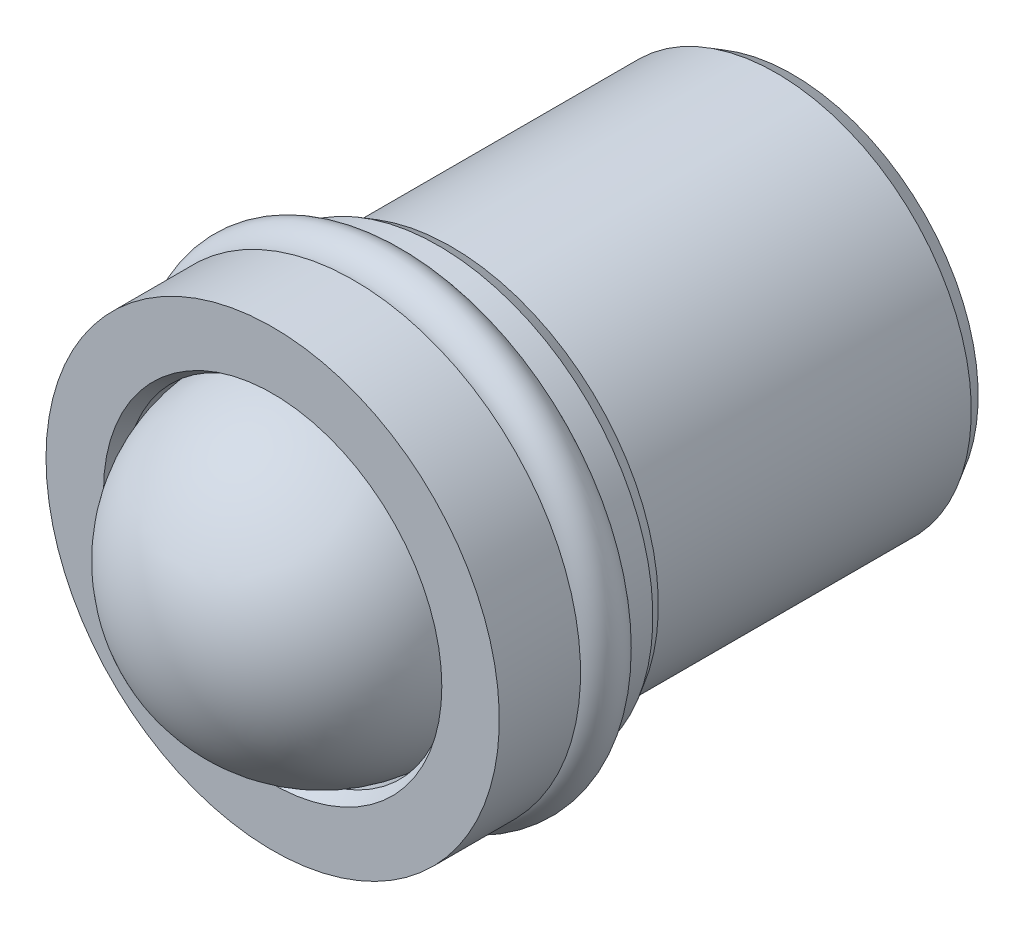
ISO-10303-21;
HEADER;
FILE_DESCRIPTION(('STEP AP214'),'2;1');
FILE_NAME('part.step','',(''),(''),'','','');
FILE_SCHEMA(('AUTOMOTIVE_DESIGN { 1 0 10303 214 1 1 1 1 }'));
ENDSEC;
DATA;
#1=APPLICATION_CONTEXT('core data for automotive mechanical design processes');
#2=APPLICATION_PROTOCOL_DEFINITION('international standard','automotive_design',2000,#1);
#3=PRODUCT_CONTEXT('',#1,'mechanical');
#4=PRODUCT('Part','Part','',(#3));
#5=PRODUCT_RELATED_PRODUCT_CATEGORY('part','',(#4));
#6=PRODUCT_DEFINITION_FORMATION('','',#4);
#7=PRODUCT_DEFINITION_CONTEXT('part definition',#1,'design');
#8=PRODUCT_DEFINITION('design','',#6,#7);
#9=PRODUCT_DEFINITION_SHAPE('','',#8);
#10=(LENGTH_UNIT() NAMED_UNIT(*) SI_UNIT(.MILLI.,.METRE.));
#11=(NAMED_UNIT(*) PLANE_ANGLE_UNIT() SI_UNIT($,.RADIAN.));
#12=(NAMED_UNIT(*) SI_UNIT($,.STERADIAN.) SOLID_ANGLE_UNIT());
#13=UNCERTAINTY_MEASURE_WITH_UNIT(LENGTH_MEASURE(1.E-05),#10,'distance_accuracy_value','');
#14=(GEOMETRIC_REPRESENTATION_CONTEXT(3) GLOBAL_UNCERTAINTY_ASSIGNED_CONTEXT((#13)) GLOBAL_UNIT_ASSIGNED_CONTEXT((#10,
#11,#12)) REPRESENTATION_CONTEXT('',''));
#15=CARTESIAN_POINT('',(0.,0.,0.));
#16=DIRECTION('',(0.,0.,1.));
#17=DIRECTION('',(1.,0.,0.));
#18=AXIS2_PLACEMENT_3D('',#15,#16,#17);
#19=CARTESIAN_POINT('',(0.,0.,-10.));
#20=DIRECTION('',(0.,0.,1.));
#21=DIRECTION('',(1.,0.,0.));
#22=AXIS2_PLACEMENT_3D('',#19,#20,#21);
#23=CONICAL_SURFACE('',#22,6.,0.523598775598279);
#24=CARTESIAN_POINT('',(0.,0.,-10.5));
#25=DIRECTION('',(0.,0.,-1.));
#26=DIRECTION('',(-1.,0.,0.));
#27=AXIS2_PLACEMENT_3D('',#24,#25,#26);
#28=CIRCLE('',#27,5.7113248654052);
#29=CARTESIAN_POINT('',(-5.7113248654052,0.,-10.5));
#30=VERTEX_POINT('',#29);
#31=EDGE_CURVE('E18',#30,#30,#28,.T.);
#32=ORIENTED_EDGE('',*,*,#31,.F.);
#33=EDGE_LOOP('',(#32));
#34=FACE_BOUND('',#33,.T.);
#35=CARTESIAN_POINT('',(0.,0.,-10.));
#36=DIRECTION('',(0.,0.,-1.));
#37=DIRECTION('',(-1.,0.,0.));
#38=AXIS2_PLACEMENT_3D('',#35,#36,#37);
#39=CIRCLE('',#38,6.);
#40=CARTESIAN_POINT('',(-6.,0.,-10.));
#41=VERTEX_POINT('',#40);
#42=EDGE_CURVE('E70',#41,#41,#39,.T.);
#43=ORIENTED_EDGE('',*,*,#42,.T.);
#44=EDGE_LOOP('',(#43));
#45=FACE_BOUND('',#44,.T.);
#46=ADVANCED_FACE('F12',(#34,#45),#23,.T.);
#47=CARTESIAN_POINT('',(0.,5.7113248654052,-10.5));
#48=DIRECTION('',(0.,0.,1.));
#49=DIRECTION('',(1.,0.,0.));
#50=AXIS2_PLACEMENT_3D('',#47,#48,#49);
#51=PLANE('',#50);
#52=ORIENTED_EDGE('',*,*,#31,.T.);
#53=EDGE_LOOP('',(#52));
#54=FACE_BOUND('',#53,.T.);
#55=ADVANCED_FACE('F168',(#54),#51,.F.);
#56=CARTESIAN_POINT('',(0.,0.,5.5));
#57=DIRECTION('',(0.,0.,-1.));
#58=DIRECTION('',(-1.,0.,0.));
#59=AXIS2_PLACEMENT_3D('',#56,#57,#58);
#60=CYLINDRICAL_SURFACE('',#59,4.975);
#61=CARTESIAN_POINT('',(0.,0.,4.49937460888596));
#62=DIRECTION('',(0.,0.,-1.));
#63=DIRECTION('',(-1.,0.,0.));
#64=AXIS2_PLACEMENT_3D('',#61,#62,#63);
#65=CIRCLE('',#64,4.975);
#66=CARTESIAN_POINT('',(-4.975,0.,4.49937460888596));
#67=VERTEX_POINT('',#66);
#68=EDGE_CURVE('E8',#67,#67,#65,.T.);
#69=ORIENTED_EDGE('',*,*,#68,.T.);
#70=EDGE_LOOP('',(#69));
#71=FACE_BOUND('',#70,.T.);
#72=CARTESIAN_POINT('',(0.,0.,5.1));
#73=DIRECTION('',(0.,0.,-1.));
#74=DIRECTION('',(-1.,0.,0.));
#75=AXIS2_PLACEMENT_3D('',#72,#73,#74);
#76=CIRCLE('',#75,4.975);
#77=CARTESIAN_POINT('',(-4.975,0.,5.1));
#78=VERTEX_POINT('',#77);
#79=EDGE_CURVE('E22',#78,#78,#76,.T.);
#80=ORIENTED_EDGE('',*,*,#79,.F.);
#81=EDGE_LOOP('',(#80));
#82=FACE_BOUND('',#81,.T.);
#83=ADVANCED_FACE('F163',(#71,#82),#60,.F.);
#84=CARTESIAN_POINT('',(0.,0.,5.1));
#85=DIRECTION('',(0.,0.,1.));
#86=DIRECTION('',(1.,0.,0.));
#87=AXIS2_PLACEMENT_3D('',#84,#85,#86);
#88=CONICAL_SURFACE('',#87,4.975,0.523598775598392);
#89=CARTESIAN_POINT('',(0.,0.,5.5));
#90=DIRECTION('',(0.,0.,-1.));
#91=DIRECTION('',(-1.,0.,0.));
#92=AXIS2_PLACEMENT_3D('',#89,#90,#91);
#93=CIRCLE('',#92,5.2059401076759);
#94=CARTESIAN_POINT('',(-5.2059401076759,0.,5.5));
#95=VERTEX_POINT('',#94);
#96=EDGE_CURVE('E26',#95,#95,#93,.T.);
#97=ORIENTED_EDGE('',*,*,#96,.F.);
#98=EDGE_LOOP('',(#97));
#99=FACE_BOUND('',#98,.T.);
#100=ORIENTED_EDGE('',*,*,#79,.T.);
#101=EDGE_LOOP('',(#100));
#102=FACE_BOUND('',#101,.T.);
#103=ADVANCED_FACE('F157',(#99,#102),#88,.F.);
#104=CARTESIAN_POINT('',(0.,5.2059401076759,5.5));
#105=DIRECTION('',(0.,0.,-1.));
#106=DIRECTION('',(-1.,0.,0.));
#107=AXIS2_PLACEMENT_3D('',#104,#105,#106);
#108=PLANE('',#107);
#109=CARTESIAN_POINT('',(0.,0.,5.5));
#110=DIRECTION('',(0.,0.,-1.));
#111=DIRECTION('',(-1.,0.,0.));
#112=AXIS2_PLACEMENT_3D('',#109,#110,#111);
#113=CIRCLE('',#112,6.975);
#114=CARTESIAN_POINT('',(-6.975,0.,5.5));
#115=VERTEX_POINT('',#114);
#116=EDGE_CURVE('E31',#115,#115,#113,.T.);
#117=ORIENTED_EDGE('',*,*,#116,.F.);
#118=EDGE_LOOP('',(#117));
#119=FACE_BOUND('',#118,.T.);
#120=ORIENTED_EDGE('',*,*,#96,.T.);
#121=EDGE_LOOP('',(#120));
#122=FACE_BOUND('',#121,.T.);
#123=ADVANCED_FACE('F151',(#119,#122),#108,.F.);
#124=CARTESIAN_POINT('',(0.,0.,5.5));
#125=DIRECTION('',(0.,0.,-1.));
#126=DIRECTION('',(-1.,0.,0.));
#127=AXIS2_PLACEMENT_3D('',#124,#125,#126);
#128=CYLINDRICAL_SURFACE('',#127,6.975);
#129=CARTESIAN_POINT('',(0.,0.,3.));
#130=DIRECTION('',(0.,0.,-1.));
#131=DIRECTION('',(-1.,0.,0.));
#132=AXIS2_PLACEMENT_3D('',#129,#130,#131);
#133=CIRCLE('',#132,6.975);
#134=CARTESIAN_POINT('',(-6.975,0.,3.));
#135=VERTEX_POINT('',#134);
#136=EDGE_CURVE('E34',#135,#135,#133,.T.);
#137=ORIENTED_EDGE('',*,*,#136,.F.);
#138=EDGE_LOOP('',(#137));
#139=FACE_BOUND('',#138,.T.);
#140=ORIENTED_EDGE('',*,*,#116,.T.);
#141=EDGE_LOOP('',(#140));
#142=FACE_BOUND('',#141,.T.);
#143=ADVANCED_FACE('F145',(#139,#142),#128,.T.);
#144=CARTESIAN_POINT('',(0.,6.975,3.));
#145=DIRECTION('',(0.,0.,1.));
#146=DIRECTION('',(1.,0.,0.));
#147=AXIS2_PLACEMENT_3D('',#144,#145,#146);
#148=PLANE('',#147);
#149=CARTESIAN_POINT('',(0.,0.,3.));
#150=DIRECTION('',(0.,0.,-1.));
#151=DIRECTION('',(-1.,0.,0.));
#152=AXIS2_PLACEMENT_3D('',#149,#150,#151);
#153=CIRCLE('',#152,5.825);
#154=CARTESIAN_POINT('',(-5.825,0.,3.));
#155=VERTEX_POINT('',#154);
#156=EDGE_CURVE('E37',#155,#155,#153,.T.);
#157=ORIENTED_EDGE('',*,*,#156,.F.);
#158=EDGE_LOOP('',(#157));
#159=FACE_BOUND('',#158,.T.);
#160=ORIENTED_EDGE('',*,*,#136,.T.);
#161=EDGE_LOOP('',(#160));
#162=FACE_BOUND('',#161,.T.);
#163=ADVANCED_FACE('F139',(#159,#162),#148,.F.);
#164=CARTESIAN_POINT('',(0.,0.,5.5));
#165=DIRECTION('',(0.,0.,-1.));
#166=DIRECTION('',(-1.,0.,0.));
#167=AXIS2_PLACEMENT_3D('',#164,#165,#166);
#168=CYLINDRICAL_SURFACE('',#167,5.825);
#169=CARTESIAN_POINT('',(0.,0.,2.85));
#170=DIRECTION('',(0.,0.,-1.));
#171=DIRECTION('',(-1.,0.,0.));
#172=AXIS2_PLACEMENT_3D('',#169,#170,#171);
#173=CIRCLE('',#172,5.825);
#174=CARTESIAN_POINT('',(-5.825,0.,2.85));
#175=VERTEX_POINT('',#174);
#176=EDGE_CURVE('E40',#175,#175,#173,.T.);
#177=ORIENTED_EDGE('',*,*,#176,.F.);
#178=EDGE_LOOP('',(#177));
#179=FACE_BOUND('',#178,.T.);
#180=ORIENTED_EDGE('',*,*,#156,.T.);
#181=EDGE_LOOP('',(#180));
#182=FACE_BOUND('',#181,.T.);
#183=ADVANCED_FACE('F133',(#179,#182),#168,.T.);
#184=CARTESIAN_POINT('',(0.,5.825,2.85));
#185=DIRECTION('',(0.,0.,-1.));
#186=DIRECTION('',(-1.,0.,0.));
#187=AXIS2_PLACEMENT_3D('',#184,#185,#186);
#188=PLANE('',#187);
#189=CARTESIAN_POINT('',(0.,0.,2.85));
#190=DIRECTION('',(0.,0.,-1.));
#191=DIRECTION('',(-1.,0.,0.));
#192=AXIS2_PLACEMENT_3D('',#189,#190,#191);
#193=CIRCLE('',#192,6.575);
#194=CARTESIAN_POINT('',(-6.575,0.,2.85));
#195=VERTEX_POINT('',#194);
#196=EDGE_CURVE('E43',#195,#195,#193,.T.);
#197=ORIENTED_EDGE('',*,*,#196,.F.);
#198=EDGE_LOOP('',(#197));
#199=FACE_BOUND('',#198,.T.);
#200=ORIENTED_EDGE('',*,*,#176,.T.);
#201=EDGE_LOOP('',(#200));
#202=FACE_BOUND('',#201,.T.);
#203=ADVANCED_FACE('F127',(#199,#202),#188,.F.);
#204=CARTESIAN_POINT('',(0.,0.,2.09999999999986));
#205=DIRECTION('',(0.,0.,-1.));
#206=DIRECTION('',(-1.,0.,0.));
#207=AXIS2_PLACEMENT_3D('',#204,#205,#206);
#208=TOROIDAL_SURFACE('',#207,6.57500000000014,0.749999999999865);
#209=CARTESIAN_POINT('',(0.,0.,1.35));
#210=DIRECTION('',(0.,0.,-1.));
#211=DIRECTION('',(-1.,0.,0.));
#212=AXIS2_PLACEMENT_3D('',#209,#210,#211);
#213=CIRCLE('',#212,6.575);
#214=CARTESIAN_POINT('',(-6.575,0.,1.35));
#215=VERTEX_POINT('',#214);
#216=EDGE_CURVE('E46',#215,#215,#213,.T.);
#217=ORIENTED_EDGE('',*,*,#216,.F.);
#218=EDGE_LOOP('',(#217));
#219=FACE_BOUND('',#218,.T.);
#220=ORIENTED_EDGE('',*,*,#196,.T.);
#221=EDGE_LOOP('',(#220));
#222=FACE_BOUND('',#221,.T.);
#223=ADVANCED_FACE('F121',(#219,#222),#208,.T.);
#224=CARTESIAN_POINT('',(0.,6.575,1.35));
#225=DIRECTION('',(0.,0.,1.));
#226=DIRECTION('',(1.,0.,0.));
#227=AXIS2_PLACEMENT_3D('',#224,#225,#226);
#228=PLANE('',#227);
#229=CARTESIAN_POINT('',(0.,0.,1.35));
#230=DIRECTION('',(0.,0.,-1.));
#231=DIRECTION('',(-1.,0.,0.));
#232=AXIS2_PLACEMENT_3D('',#229,#230,#231);
#233=CIRCLE('',#232,5.825);
#234=CARTESIAN_POINT('',(-5.825,0.,1.35));
#235=VERTEX_POINT('',#234);
#236=EDGE_CURVE('E49',#235,#235,#233,.T.);
#237=ORIENTED_EDGE('',*,*,#236,.F.);
#238=EDGE_LOOP('',(#237));
#239=FACE_BOUND('',#238,.T.);
#240=ORIENTED_EDGE('',*,*,#216,.T.);
#241=EDGE_LOOP('',(#240));
#242=FACE_BOUND('',#241,.T.);
#243=ADVANCED_FACE('F115',(#239,#242),#228,.F.);
#244=CARTESIAN_POINT('',(0.,0.,5.5));
#245=DIRECTION('',(0.,0.,-1.));
#246=DIRECTION('',(-1.,0.,0.));
#247=AXIS2_PLACEMENT_3D('',#244,#245,#246);
#248=CYLINDRICAL_SURFACE('',#247,5.825);
#249=CARTESIAN_POINT('',(0.,0.,1.2));
#250=DIRECTION('',(0.,0.,-1.));
#251=DIRECTION('',(-1.,0.,0.));
#252=AXIS2_PLACEMENT_3D('',#249,#250,#251);
#253=CIRCLE('',#252,5.825);
#254=CARTESIAN_POINT('',(-5.825,0.,1.2));
#255=VERTEX_POINT('',#254);
#256=EDGE_CURVE('E52',#255,#255,#253,.T.);
#257=ORIENTED_EDGE('',*,*,#256,.F.);
#258=EDGE_LOOP('',(#257));
#259=FACE_BOUND('',#258,.T.);
#260=ORIENTED_EDGE('',*,*,#236,.T.);
#261=EDGE_LOOP('',(#260));
#262=FACE_BOUND('',#261,.T.);
#263=ADVANCED_FACE('F109',(#259,#262),#248,.T.);
#264=CARTESIAN_POINT('',(0.,5.825,1.2));
#265=DIRECTION('',(0.,0.,-1.));
#266=DIRECTION('',(-1.,0.,0.));
#267=AXIS2_PLACEMENT_3D('',#264,#265,#266);
#268=PLANE('',#267);
#269=CARTESIAN_POINT('',(0.,0.,1.2));
#270=DIRECTION('',(0.,0.,-1.));
#271=DIRECTION('',(-1.,0.,0.));
#272=AXIS2_PLACEMENT_3D('',#269,#270,#271);
#273=CIRCLE('',#272,6.6);
#274=CARTESIAN_POINT('',(-6.6,0.,1.2));
#275=VERTEX_POINT('',#274);
#276=EDGE_CURVE('E55',#275,#275,#273,.T.);
#277=ORIENTED_EDGE('',*,*,#276,.F.);
#278=EDGE_LOOP('',(#277));
#279=FACE_BOUND('',#278,.T.);
#280=ORIENTED_EDGE('',*,*,#256,.T.);
#281=EDGE_LOOP('',(#280));
#282=FACE_BOUND('',#281,.T.);
#283=ADVANCED_FACE('F103',(#279,#282),#268,.F.);
#284=CARTESIAN_POINT('',(0.,0.,5.5));
#285=DIRECTION('',(0.,0.,-1.));
#286=DIRECTION('',(-1.,0.,0.));
#287=AXIS2_PLACEMENT_3D('',#284,#285,#286);
#288=CYLINDRICAL_SURFACE('',#287,6.6);
#289=CARTESIAN_POINT('',(0.,0.,0.4));
#290=DIRECTION('',(0.,0.,-1.));
#291=DIRECTION('',(-1.,0.,0.));
#292=AXIS2_PLACEMENT_3D('',#289,#290,#291);
#293=CIRCLE('',#292,6.6);
#294=CARTESIAN_POINT('',(-6.6,0.,0.4));
#295=VERTEX_POINT('',#294);
#296=EDGE_CURVE('E58',#295,#295,#293,.T.);
#297=ORIENTED_EDGE('',*,*,#296,.F.);
#298=EDGE_LOOP('',(#297));
#299=FACE_BOUND('',#298,.T.);
#300=ORIENTED_EDGE('',*,*,#276,.T.);
#301=EDGE_LOOP('',(#300));
#302=FACE_BOUND('',#301,.T.);
#303=ADVANCED_FACE('F97',(#299,#302),#288,.T.);
#304=CARTESIAN_POINT('',(0.,0.,0.4));
#305=DIRECTION('',(0.,0.,1.));
#306=DIRECTION('',(1.,0.,0.));
#307=AXIS2_PLACEMENT_3D('',#304,#305,#306);
#308=CONICAL_SURFACE('',#307,6.6,0.523598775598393);
#309=CARTESIAN_POINT('',(0.,0.,0.));
#310=DIRECTION('',(0.,0.,-1.));
#311=DIRECTION('',(-1.,0.,0.));
#312=AXIS2_PLACEMENT_3D('',#309,#310,#311);
#313=CIRCLE('',#312,6.3690598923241);
#314=CARTESIAN_POINT('',(-6.3690598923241,0.,0.));
#315=VERTEX_POINT('',#314);
#316=EDGE_CURVE('E61',#315,#315,#313,.T.);
#317=ORIENTED_EDGE('',*,*,#316,.F.);
#318=EDGE_LOOP('',(#317));
#319=FACE_BOUND('',#318,.T.);
#320=ORIENTED_EDGE('',*,*,#296,.T.);
#321=EDGE_LOOP('',(#320));
#322=FACE_BOUND('',#321,.T.);
#323=ADVANCED_FACE('F91',(#319,#322),#308,.T.);
#324=CARTESIAN_POINT('',(0.,6.3690598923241,0.));
#325=DIRECTION('',(0.,0.,1.));
#326=DIRECTION('',(1.,0.,0.));
#327=AXIS2_PLACEMENT_3D('',#324,#325,#326);
#328=PLANE('',#327);
#329=CARTESIAN_POINT('',(0.,0.,0.));
#330=DIRECTION('',(0.,0.,-1.));
#331=DIRECTION('',(-1.,0.,0.));
#332=AXIS2_PLACEMENT_3D('',#329,#330,#331);
#333=CIRCLE('',#332,6.2);
#334=CARTESIAN_POINT('',(-6.2,0.,0.));
#335=VERTEX_POINT('',#334);
#336=EDGE_CURVE('E64',#335,#335,#333,.T.);
#337=ORIENTED_EDGE('',*,*,#336,.F.);
#338=EDGE_LOOP('',(#337));
#339=FACE_BOUND('',#338,.T.);
#340=ORIENTED_EDGE('',*,*,#316,.T.);
#341=EDGE_LOOP('',(#340));
#342=FACE_BOUND('',#341,.T.);
#343=ADVANCED_FACE('F85',(#339,#342),#328,.F.);
#344=CARTESIAN_POINT('',(0.,0.,-0.200000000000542));
#345=DIRECTION('',(0.,0.,-1.));
#346=DIRECTION('',(-1.,0.,0.));
#347=AXIS2_PLACEMENT_3D('',#344,#345,#346);
#348=TOROIDAL_SURFACE('',#347,6.20000000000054,0.200000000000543);
#349=CARTESIAN_POINT('',(0.,0.,-0.2));
#350=DIRECTION('',(0.,0.,-1.));
#351=DIRECTION('',(-1.,0.,0.));
#352=AXIS2_PLACEMENT_3D('',#349,#350,#351);
#353=CIRCLE('',#352,6.);
#354=CARTESIAN_POINT('',(-6.,0.,-0.2));
#355=VERTEX_POINT('',#354);
#356=EDGE_CURVE('E67',#355,#355,#353,.T.);
#357=ORIENTED_EDGE('',*,*,#356,.F.);
#358=EDGE_LOOP('',(#357));
#359=FACE_BOUND('',#358,.T.);
#360=ORIENTED_EDGE('',*,*,#336,.T.);
#361=EDGE_LOOP('',(#360));
#362=FACE_BOUND('',#361,.T.);
#363=ADVANCED_FACE('F79',(#359,#362),#348,.F.);
#364=CARTESIAN_POINT('',(0.,0.,5.5));
#365=DIRECTION('',(0.,0.,-1.));
#366=DIRECTION('',(-1.,0.,0.));
#367=AXIS2_PLACEMENT_3D('',#364,#365,#366);
#368=CYLINDRICAL_SURFACE('',#367,6.);
#369=ORIENTED_EDGE('',*,*,#42,.F.);
#370=EDGE_LOOP('',(#369));
#371=FACE_BOUND('',#370,.T.);
#372=ORIENTED_EDGE('',*,*,#356,.T.);
#373=EDGE_LOOP('',(#372));
#374=FACE_BOUND('',#373,.T.);
#375=ADVANCED_FACE('F75',(#371,#374),#368,.T.);
#376=CARTESIAN_POINT('',(0.,0.,4.));
#377=DIRECTION('',(0.,0.,-1.));
#378=DIRECTION('',(0.,-1.,0.));
#379=AXIS2_PLACEMENT_3D('',#376,#377,#378);
#380=SPHERICAL_SURFACE('',#379,5.);
#381=ORIENTED_EDGE('',*,*,#68,.F.);
#382=EDGE_LOOP('',(#381));
#383=FACE_BOUND('',#382,.T.);
#384=ADVANCED_FACE('F78',(#383),#380,.T.);
#385=CLOSED_SHELL('',(#46,#55,#83,#103,#123,#143,#163,#183,#203,#223,#243,#263,#283,#303,#323,
#343,#363,#375,#384));
#386=MANIFOLD_SOLID_BREP('B1',#385);
#387=ADVANCED_BREP_SHAPE_REPRESENTATION('',(#18,#386),#14);
#388=SHAPE_DEFINITION_REPRESENTATION(#9,#387);
ENDSEC;
END-ISO-10303-21;
